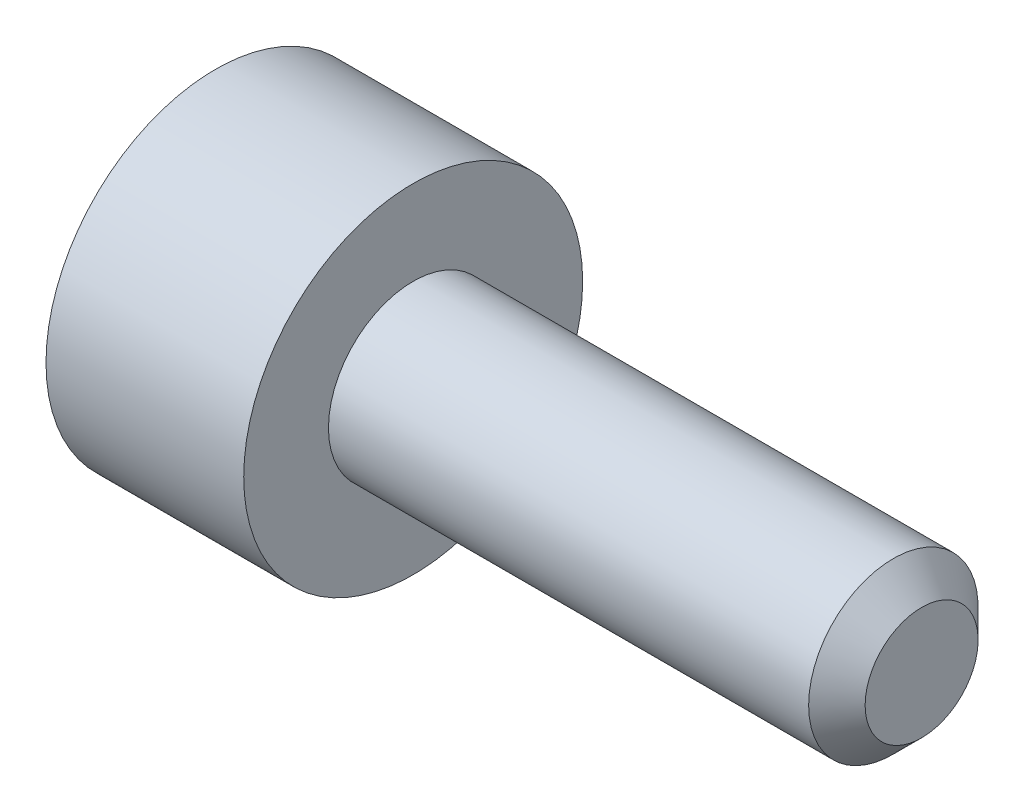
ISO-10303-21;
HEADER;
FILE_DESCRIPTION(('STEP AP214'),'2;1');
FILE_NAME('part.step','',(''),(''),'','','');
FILE_SCHEMA(('AUTOMOTIVE_DESIGN { 1 0 10303 214 1 1 1 1 }'));
ENDSEC;
DATA;
#1=APPLICATION_CONTEXT('core data for automotive mechanical design processes');
#2=APPLICATION_PROTOCOL_DEFINITION('international standard','automotive_design',2000,#1);
#3=PRODUCT_CONTEXT('',#1,'mechanical');
#4=PRODUCT('Part','Part','',(#3));
#5=PRODUCT_RELATED_PRODUCT_CATEGORY('part','',(#4));
#6=PRODUCT_DEFINITION_FORMATION('','',#4);
#7=PRODUCT_DEFINITION_CONTEXT('part definition',#1,'design');
#8=PRODUCT_DEFINITION('design','',#6,#7);
#9=PRODUCT_DEFINITION_SHAPE('','',#8);
#10=(LENGTH_UNIT() NAMED_UNIT(*) SI_UNIT(.MILLI.,.METRE.));
#11=(NAMED_UNIT(*) PLANE_ANGLE_UNIT() SI_UNIT($,.RADIAN.));
#12=(NAMED_UNIT(*) SI_UNIT($,.STERADIAN.) SOLID_ANGLE_UNIT());
#13=UNCERTAINTY_MEASURE_WITH_UNIT(LENGTH_MEASURE(1.E-05),#10,'distance_accuracy_value','');
#14=(GEOMETRIC_REPRESENTATION_CONTEXT(3) GLOBAL_UNCERTAINTY_ASSIGNED_CONTEXT((#13)) GLOBAL_UNIT_ASSIGNED_CONTEXT((#10,
#11,#12)) REPRESENTATION_CONTEXT('',''));
#15=CARTESIAN_POINT('',(0.,0.,0.));
#16=DIRECTION('',(0.,0.,1.));
#17=DIRECTION('',(1.,0.,0.));
#18=AXIS2_PLACEMENT_3D('',#15,#16,#17);
#19=CARTESIAN_POINT('',(0.,0.,0.));
#20=DIRECTION('',(1.,0.,0.));
#21=DIRECTION('',(0.,0.,-1.));
#22=AXIS2_PLACEMENT_3D('',#19,#20,#21);
#23=PLANE('',#22);
#24=DIRECTION('',(0.,0.,-1.));
#25=VECTOR('',#24,1.);
#26=CARTESIAN_POINT('',(0.,2.,1.15470053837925));
#27=LINE('',#26,#25);
#28=CARTESIAN_POINT('',(0.,2.,1.15470053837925));
#29=VERTEX_POINT('',#28);
#30=CARTESIAN_POINT('',(0.,2.,-1.15470053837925));
#31=VERTEX_POINT('',#30);
#32=EDGE_CURVE('E96',#29,#31,#27,.T.);
#33=ORIENTED_EDGE('',*,*,#32,.F.);
#34=DIRECTION('',(0.,0.866025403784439,-0.5));
#35=VECTOR('',#34,1.);
#36=CARTESIAN_POINT('',(0.,0.,2.3094010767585));
#37=LINE('',#36,#35);
#38=CARTESIAN_POINT('',(0.,0.,2.3094010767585));
#39=VERTEX_POINT('',#38);
#40=EDGE_CURVE('E42',#39,#29,#37,.T.);
#41=ORIENTED_EDGE('',*,*,#40,.F.);
#42=DIRECTION('',(0.,0.866025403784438,0.5));
#43=VECTOR('',#42,1.);
#44=CARTESIAN_POINT('',(0.,-2.,1.15470053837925));
#45=LINE('',#44,#43);
#46=CARTESIAN_POINT('',(0.,-2.,1.15470053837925));
#47=VERTEX_POINT('',#46);
#48=EDGE_CURVE('E111',#47,#39,#45,.T.);
#49=ORIENTED_EDGE('',*,*,#48,.F.);
#50=DIRECTION('',(0.,0.,1.));
#51=VECTOR('',#50,1.);
#52=CARTESIAN_POINT('',(0.,-2.,-1.15470053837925));
#53=LINE('',#52,#51);
#54=CARTESIAN_POINT('',(0.,-2.,-1.15470053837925));
#55=VERTEX_POINT('',#54);
#56=EDGE_CURVE('E105',#55,#47,#53,.T.);
#57=ORIENTED_EDGE('',*,*,#56,.F.);
#58=DIRECTION('',(0.,-0.866025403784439,0.5));
#59=VECTOR('',#58,1.);
#60=CARTESIAN_POINT('',(0.,0.,-2.3094010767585));
#61=LINE('',#60,#59);
#62=CARTESIAN_POINT('',(0.,0.,-2.3094010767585));
#63=VERTEX_POINT('',#62);
#64=EDGE_CURVE('E103',#63,#55,#61,.T.);
#65=ORIENTED_EDGE('',*,*,#64,.F.);
#66=DIRECTION('',(0.,-0.866025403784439,-0.5));
#67=VECTOR('',#66,1.);
#68=CARTESIAN_POINT('',(0.,2.,-1.15470053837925));
#69=LINE('',#68,#67);
#70=EDGE_CURVE('E85',#31,#63,#69,.T.);
#71=ORIENTED_EDGE('',*,*,#70,.F.);
#72=EDGE_LOOP('',(#33,#41,#49,#57,#65,#71));
#73=FACE_BOUND('',#72,.T.);
#74=CARTESIAN_POINT('',(0.,0.,0.));
#75=DIRECTION('',(-1.,0.,0.));
#76=DIRECTION('',(0.,0.,1.));
#77=AXIS2_PLACEMENT_3D('',#74,#75,#76);
#78=CIRCLE('',#77,3.);
#79=CARTESIAN_POINT('',(0.,0.,3.));
#80=VERTEX_POINT('',#79);
#81=EDGE_CURVE('E141',#80,#80,#78,.T.);
#82=ORIENTED_EDGE('',*,*,#81,.T.);
#83=EDGE_LOOP('',(#82));
#84=FACE_BOUND('',#83,.T.);
#85=ADVANCED_FACE('F28',(#73,#84),#23,.F.);
#86=CARTESIAN_POINT('',(-12.5636241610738,0.,0.));
#87=DIRECTION('',(-1.,0.,0.));
#88=DIRECTION('',(0.,0.,1.));
#89=AXIS2_PLACEMENT_3D('',#86,#87,#88);
#90=CYLINDRICAL_SURFACE('',#89,3.);
#91=ORIENTED_EDGE('',*,*,#81,.F.);
#92=EDGE_LOOP('',(#91));
#93=FACE_BOUND('',#92,.T.);
#94=CARTESIAN_POINT('',(3.5,0.,0.));
#95=DIRECTION('',(-1.,0.,0.));
#96=DIRECTION('',(0.,0.,1.));
#97=AXIS2_PLACEMENT_3D('',#94,#95,#96);
#98=CIRCLE('',#97,3.);
#99=CARTESIAN_POINT('',(3.5,0.,3.));
#100=VERTEX_POINT('',#99);
#101=EDGE_CURVE('E138',#100,#100,#98,.T.);
#102=ORIENTED_EDGE('',*,*,#101,.T.);
#103=EDGE_LOOP('',(#102));
#104=FACE_BOUND('',#103,.T.);
#105=ADVANCED_FACE('F161',(#93,#104),#90,.T.);
#106=CARTESIAN_POINT('',(3.5,3.,0.));
#107=DIRECTION('',(-1.,0.,0.));
#108=DIRECTION('',(0.,0.,1.));
#109=AXIS2_PLACEMENT_3D('',#106,#107,#108);
#110=PLANE('',#109);
#111=ORIENTED_EDGE('',*,*,#101,.F.);
#112=EDGE_LOOP('',(#111));
#113=FACE_BOUND('',#112,.T.);
#114=CARTESIAN_POINT('',(3.5,0.,0.));
#115=DIRECTION('',(-1.,0.,0.));
#116=DIRECTION('',(0.,0.,1.));
#117=AXIS2_PLACEMENT_3D('',#114,#115,#116);
#118=CIRCLE('',#117,1.5);
#119=CARTESIAN_POINT('',(3.5,0.,1.5));
#120=VERTEX_POINT('',#119);
#121=EDGE_CURVE('E129',#120,#120,#118,.T.);
#122=ORIENTED_EDGE('',*,*,#121,.T.);
#123=EDGE_LOOP('',(#122));
#124=FACE_BOUND('',#123,.T.);
#125=ADVANCED_FACE('F165',(#113,#124),#110,.F.);
#126=CARTESIAN_POINT('',(-12.5636241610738,0.,0.));
#127=DIRECTION('',(-1.,0.,0.));
#128=DIRECTION('',(0.,0.,1.));
#129=AXIS2_PLACEMENT_3D('',#126,#127,#128);
#130=CYLINDRICAL_SURFACE('',#129,1.5);
#131=CARTESIAN_POINT('',(12.,0.,0.));
#132=DIRECTION('',(-1.,0.,0.));
#133=DIRECTION('',(0.,0.,1.));
#134=AXIS2_PLACEMENT_3D('',#131,#132,#133);
#135=CIRCLE('',#134,1.5);
#136=CARTESIAN_POINT('',(12.,0.,1.5));
#137=VERTEX_POINT('',#136);
#138=EDGE_CURVE('E35',#137,#137,#135,.T.);
#139=ORIENTED_EDGE('',*,*,#138,.T.);
#140=EDGE_LOOP('',(#139));
#141=FACE_BOUND('',#140,.T.);
#142=ORIENTED_EDGE('',*,*,#121,.F.);
#143=EDGE_LOOP('',(#142));
#144=FACE_BOUND('',#143,.T.);
#145=ADVANCED_FACE('F146',(#141,#144),#130,.T.);
#146=CARTESIAN_POINT('',(12.5,1.5,0.));
#147=DIRECTION('',(-1.,0.,0.));
#148=DIRECTION('',(0.,0.,1.));
#149=AXIS2_PLACEMENT_3D('',#146,#147,#148);
#150=PLANE('',#149);
#151=CARTESIAN_POINT('',(12.5,0.,0.));
#152=DIRECTION('',(-1.,0.,0.));
#153=DIRECTION('',(0.,0.,1.));
#154=AXIS2_PLACEMENT_3D('',#151,#152,#153);
#155=CIRCLE('',#154,0.999999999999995);
#156=CARTESIAN_POINT('',(12.5,0.,0.999999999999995));
#157=VERTEX_POINT('',#156);
#158=EDGE_CURVE('E11',#157,#157,#155,.F.);
#159=ORIENTED_EDGE('',*,*,#158,.T.);
#160=EDGE_LOOP('',(#159));
#161=FACE_BOUND('',#160,.T.);
#162=ADVANCED_FACE('F177',(#161),#150,.F.);
#163=CARTESIAN_POINT('',(3.,0.,2.3094010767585));
#164=DIRECTION('',(0.,0.5,0.866025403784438));
#165=DIRECTION('',(0.,-0.866025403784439,0.5));
#166=AXIS2_PLACEMENT_3D('',#163,#164,#165);
#167=PLANE('',#166);
#168=ORIENTED_EDGE('',*,*,#40,.T.);
#169=DIRECTION('',(-1.,0.,0.));
#170=VECTOR('',#169,1.);
#171=CARTESIAN_POINT('',(3.,2.,1.15470053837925));
#172=LINE('',#171,#170);
#173=CARTESIAN_POINT('',(3.,2.,1.15470053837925));
#174=VERTEX_POINT('',#173);
#175=EDGE_CURVE('E93',#174,#29,#172,.T.);
#176=ORIENTED_EDGE('',*,*,#175,.F.);
#177=DIRECTION('',(0.,0.866025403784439,-0.5));
#178=VECTOR('',#177,1.);
#179=CARTESIAN_POINT('',(3.,0.,2.3094010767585));
#180=LINE('',#179,#178);
#181=CARTESIAN_POINT('',(3.,0.,2.3094010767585));
#182=VERTEX_POINT('',#181);
#183=EDGE_CURVE('E113',#182,#174,#180,.T.);
#184=ORIENTED_EDGE('',*,*,#183,.F.);
#185=DIRECTION('',(-1.,0.,0.));
#186=VECTOR('',#185,1.);
#187=CARTESIAN_POINT('',(3.,0.,2.3094010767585));
#188=LINE('',#187,#186);
#189=EDGE_CURVE('E49',#182,#39,#188,.T.);
#190=ORIENTED_EDGE('',*,*,#189,.T.);
#191=EDGE_LOOP('',(#168,#176,#184,#190));
#192=FACE_BOUND('',#191,.T.);
#193=ADVANCED_FACE('F180',(#192),#167,.F.);
#194=CARTESIAN_POINT('',(3.,-2.,1.15470053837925));
#195=DIRECTION('',(0.,-0.5,0.866025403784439));
#196=DIRECTION('',(0.,-0.866025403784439,-0.5));
#197=AXIS2_PLACEMENT_3D('',#194,#195,#196);
#198=PLANE('',#197);
#199=ORIENTED_EDGE('',*,*,#48,.T.);
#200=ORIENTED_EDGE('',*,*,#189,.F.);
#201=DIRECTION('',(0.,0.866025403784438,0.5));
#202=VECTOR('',#201,1.);
#203=CARTESIAN_POINT('',(3.,-2.,1.15470053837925));
#204=LINE('',#203,#202);
#205=CARTESIAN_POINT('',(3.,-2.,1.15470053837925));
#206=VERTEX_POINT('',#205);
#207=EDGE_CURVE('E125',#206,#182,#204,.T.);
#208=ORIENTED_EDGE('',*,*,#207,.F.);
#209=DIRECTION('',(-1.,0.,0.));
#210=VECTOR('',#209,1.);
#211=CARTESIAN_POINT('',(3.,-2.,1.15470053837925));
#212=LINE('',#211,#210);
#213=EDGE_CURVE('E130',#206,#47,#212,.T.);
#214=ORIENTED_EDGE('',*,*,#213,.T.);
#215=EDGE_LOOP('',(#199,#200,#208,#214));
#216=FACE_BOUND('',#215,.T.);
#217=ADVANCED_FACE('F184',(#216),#198,.F.);
#218=CARTESIAN_POINT('',(3.,-2.,-1.15470053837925));
#219=DIRECTION('',(0.,-1.,0.));
#220=DIRECTION('',(0.,0.,-1.));
#221=AXIS2_PLACEMENT_3D('',#218,#219,#220);
#222=PLANE('',#221);
#223=ORIENTED_EDGE('',*,*,#56,.T.);
#224=ORIENTED_EDGE('',*,*,#213,.F.);
#225=DIRECTION('',(0.,0.,1.));
#226=VECTOR('',#225,1.);
#227=CARTESIAN_POINT('',(3.,-2.,-1.15470053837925));
#228=LINE('',#227,#226);
#229=CARTESIAN_POINT('',(3.,-2.,-1.15470053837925));
#230=VERTEX_POINT('',#229);
#231=EDGE_CURVE('E122',#230,#206,#228,.T.);
#232=ORIENTED_EDGE('',*,*,#231,.F.);
#233=DIRECTION('',(-1.,0.,0.));
#234=VECTOR('',#233,1.);
#235=CARTESIAN_POINT('',(3.,-2.,-1.15470053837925));
#236=LINE('',#235,#234);
#237=EDGE_CURVE('E132',#230,#55,#236,.T.);
#238=ORIENTED_EDGE('',*,*,#237,.T.);
#239=EDGE_LOOP('',(#223,#224,#232,#238));
#240=FACE_BOUND('',#239,.T.);
#241=ADVANCED_FACE('F192',(#240),#222,.F.);
#242=CARTESIAN_POINT('',(3.,0.,-2.3094010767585));
#243=DIRECTION('',(0.,-0.5,-0.866025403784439));
#244=DIRECTION('',(0.,0.866025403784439,-0.5));
#245=AXIS2_PLACEMENT_3D('',#242,#243,#244);
#246=PLANE('',#245);
#247=ORIENTED_EDGE('',*,*,#64,.T.);
#248=ORIENTED_EDGE('',*,*,#237,.F.);
#249=DIRECTION('',(0.,-0.866025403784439,0.5));
#250=VECTOR('',#249,1.);
#251=CARTESIAN_POINT('',(3.,0.,-2.3094010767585));
#252=LINE('',#251,#250);
#253=CARTESIAN_POINT('',(3.,0.,-2.3094010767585));
#254=VERTEX_POINT('',#253);
#255=EDGE_CURVE('E119',#254,#230,#252,.T.);
#256=ORIENTED_EDGE('',*,*,#255,.F.);
#257=DIRECTION('',(-1.,0.,0.));
#258=VECTOR('',#257,1.);
#259=CARTESIAN_POINT('',(3.,0.,-2.3094010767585));
#260=LINE('',#259,#258);
#261=EDGE_CURVE('E92',#254,#63,#260,.T.);
#262=ORIENTED_EDGE('',*,*,#261,.T.);
#263=EDGE_LOOP('',(#247,#248,#256,#262));
#264=FACE_BOUND('',#263,.T.);
#265=ADVANCED_FACE('F189',(#264),#246,.F.);
#266=CARTESIAN_POINT('',(3.,2.,-1.15470053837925));
#267=DIRECTION('',(0.,0.5,-0.866025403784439));
#268=DIRECTION('',(0.,0.866025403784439,0.5));
#269=AXIS2_PLACEMENT_3D('',#266,#267,#268);
#270=PLANE('',#269);
#271=ORIENTED_EDGE('',*,*,#70,.T.);
#272=ORIENTED_EDGE('',*,*,#261,.F.);
#273=DIRECTION('',(0.,-0.866025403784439,-0.5));
#274=VECTOR('',#273,1.);
#275=CARTESIAN_POINT('',(3.,2.,-1.15470053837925));
#276=LINE('',#275,#274);
#277=CARTESIAN_POINT('',(3.,2.,-1.15470053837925));
#278=VERTEX_POINT('',#277);
#279=EDGE_CURVE('E88',#278,#254,#276,.T.);
#280=ORIENTED_EDGE('',*,*,#279,.F.);
#281=DIRECTION('',(-1.,0.,0.));
#282=VECTOR('',#281,1.);
#283=CARTESIAN_POINT('',(3.,2.,-1.15470053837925));
#284=LINE('',#283,#282);
#285=EDGE_CURVE('E81',#278,#31,#284,.T.);
#286=ORIENTED_EDGE('',*,*,#285,.T.);
#287=EDGE_LOOP('',(#271,#272,#280,#286));
#288=FACE_BOUND('',#287,.T.);
#289=ADVANCED_FACE('F83',(#288),#270,.F.);
#290=CARTESIAN_POINT('',(3.,2.,1.15470053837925));
#291=DIRECTION('',(0.,1.,0.));
#292=DIRECTION('',(0.,0.,1.));
#293=AXIS2_PLACEMENT_3D('',#290,#291,#292);
#294=PLANE('',#293);
#295=ORIENTED_EDGE('',*,*,#32,.T.);
#296=ORIENTED_EDGE('',*,*,#285,.F.);
#297=DIRECTION('',(0.,0.,-1.));
#298=VECTOR('',#297,1.);
#299=CARTESIAN_POINT('',(3.,2.,1.15470053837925));
#300=LINE('',#299,#298);
#301=EDGE_CURVE('E116',#174,#278,#300,.T.);
#302=ORIENTED_EDGE('',*,*,#301,.F.);
#303=ORIENTED_EDGE('',*,*,#175,.T.);
#304=EDGE_LOOP('',(#295,#296,#302,#303));
#305=FACE_BOUND('',#304,.T.);
#306=ADVANCED_FACE('F97',(#305),#294,.F.);
#307=CARTESIAN_POINT('',(3.,0.,2.3094010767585));
#308=DIRECTION('',(1.,0.,0.));
#309=DIRECTION('',(0.,0.,-1.));
#310=AXIS2_PLACEMENT_3D('',#307,#308,#309);
#311=PLANE('',#310);
#312=ORIENTED_EDGE('',*,*,#183,.T.);
#313=ORIENTED_EDGE('',*,*,#301,.T.);
#314=ORIENTED_EDGE('',*,*,#279,.T.);
#315=ORIENTED_EDGE('',*,*,#255,.T.);
#316=ORIENTED_EDGE('',*,*,#231,.T.);
#317=ORIENTED_EDGE('',*,*,#207,.T.);
#318=EDGE_LOOP('',(#312,#313,#314,#315,#316,#317));
#319=FACE_BOUND('',#318,.T.);
#320=ADVANCED_FACE('F151',(#319),#311,.F.);
#321=CARTESIAN_POINT('',(12.,0.,0.));
#322=DIRECTION('',(-1.,0.,0.));
#323=DIRECTION('',(0.,0.,1.));
#324=AXIS2_PLACEMENT_3D('',#321,#322,#323);
#325=CONICAL_SURFACE('',#324,1.5,0.785398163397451);
#326=ORIENTED_EDGE('',*,*,#158,.F.);
#327=EDGE_LOOP('',(#326));
#328=FACE_BOUND('',#327,.T.);
#329=ORIENTED_EDGE('',*,*,#138,.F.);
#330=EDGE_LOOP('',(#329));
#331=FACE_BOUND('',#330,.T.);
#332=ADVANCED_FACE('F149',(#328,#331),#325,.T.);
#333=CLOSED_SHELL('',(#85,#105,#125,#145,#162,#193,#217,#241,#265,#289,#306,#320,#332));
#334=MANIFOLD_SOLID_BREP('B2',#333);
#335=ADVANCED_BREP_SHAPE_REPRESENTATION('',(#18,#334),#14);
#336=SHAPE_DEFINITION_REPRESENTATION(#9,#335);
ENDSEC;
END-ISO-10303-21;
